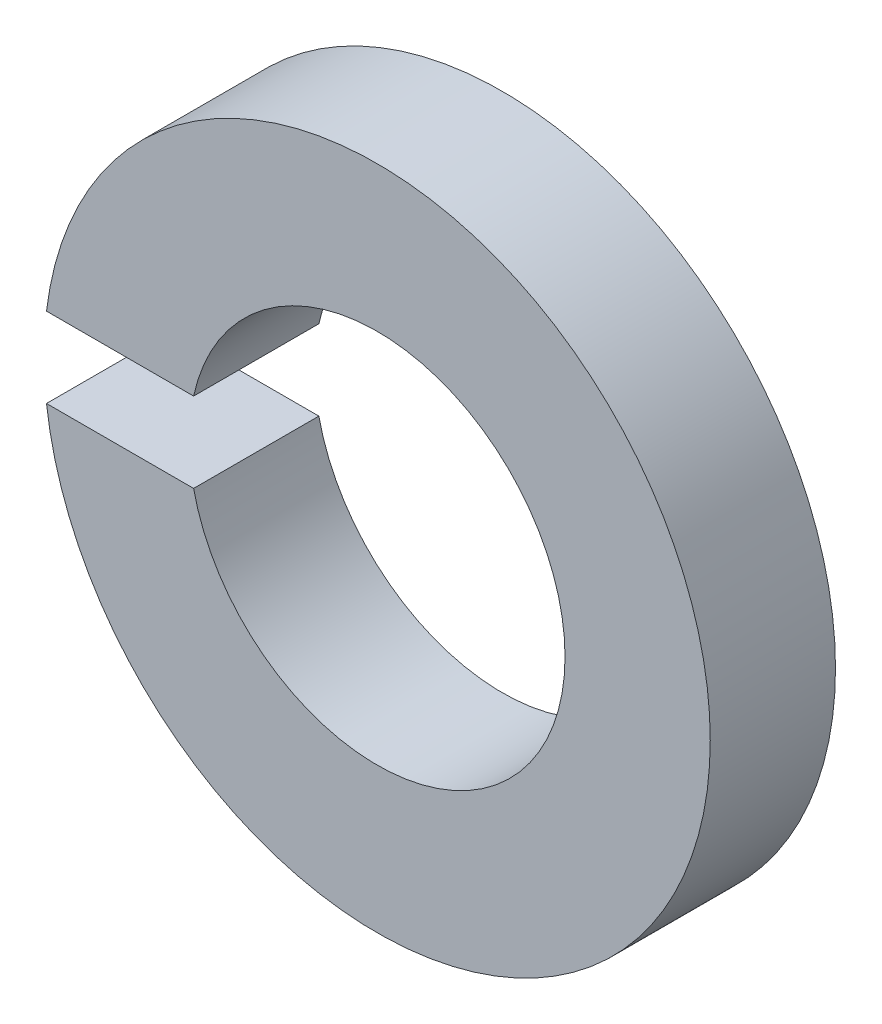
from build123d import *

# Parameters (mm, degrees)
BOSS_EXTRUDE1_DEPTH = 1.1938


with BuildPart() as part:
    # Sketch2 → Boss-Extrude1 (new body)
    with BuildSketch(Plane.XY):
        with BuildLine():
            Line((-1.749698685, 0.381), (-3.152057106, 0.381))
            ThreePointArc((-3.152057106, 0.381), (3.175, 0), (-3.152057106, -0.381))
            Line((-3.152057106, -0.381), (-1.749698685, -0.381))
            ThreePointArc((-1.749698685, -0.381), (1.7907, 0), (-1.749698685, 0.381))
        make_face()
    extrude(amount=BOSS_EXTRUDE1_DEPTH)


solid = part.part
